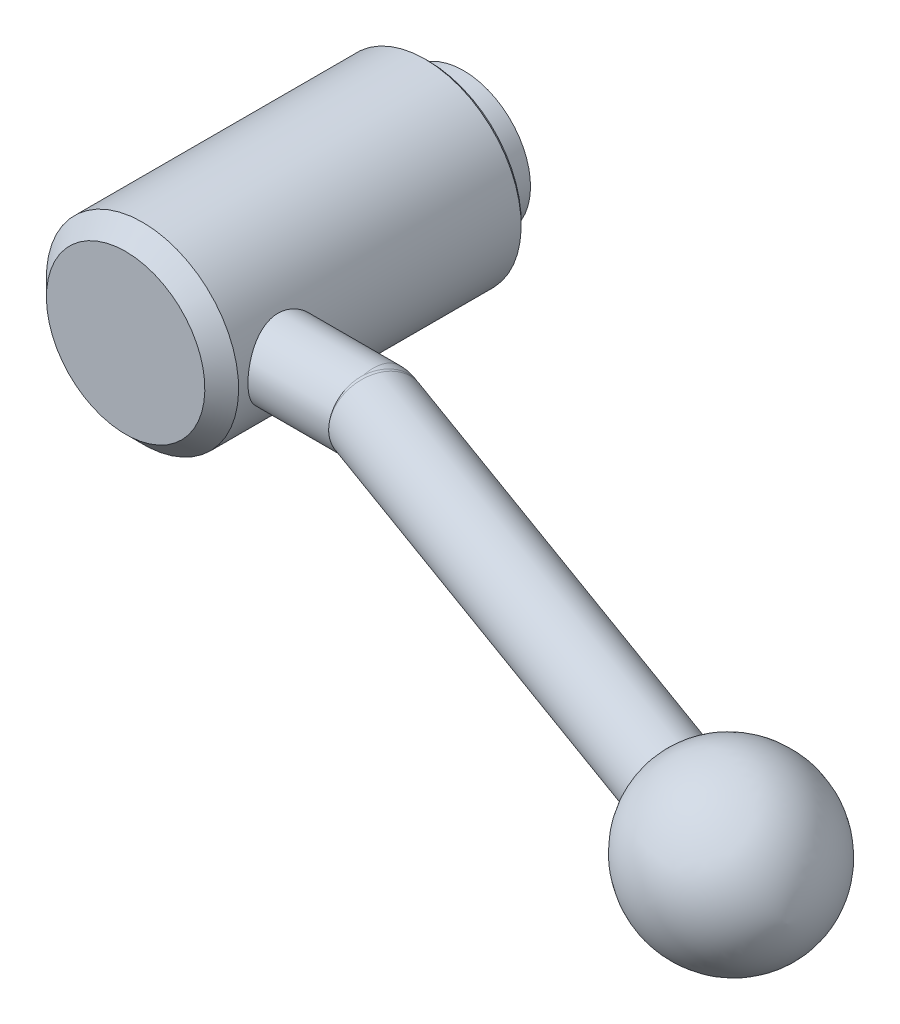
ISO-10303-21;
HEADER;
FILE_DESCRIPTION(('STEP AP214'),'2;1');
FILE_NAME('part.step','',(''),(''),'','','');
FILE_SCHEMA(('AUTOMOTIVE_DESIGN { 1 0 10303 214 1 1 1 1 }'));
ENDSEC;
DATA;
#1=APPLICATION_CONTEXT('core data for automotive mechanical design processes');
#2=APPLICATION_PROTOCOL_DEFINITION('international standard','automotive_design',2000,#1);
#3=PRODUCT_CONTEXT('',#1,'mechanical');
#4=PRODUCT('Part','Part','',(#3));
#5=PRODUCT_RELATED_PRODUCT_CATEGORY('part','',(#4));
#6=PRODUCT_DEFINITION_FORMATION('','',#4);
#7=PRODUCT_DEFINITION_CONTEXT('part definition',#1,'design');
#8=PRODUCT_DEFINITION('design','',#6,#7);
#9=PRODUCT_DEFINITION_SHAPE('','',#8);
#10=(LENGTH_UNIT() NAMED_UNIT(*) SI_UNIT(.MILLI.,.METRE.));
#11=(NAMED_UNIT(*) PLANE_ANGLE_UNIT() SI_UNIT($,.RADIAN.));
#12=(NAMED_UNIT(*) SI_UNIT($,.STERADIAN.) SOLID_ANGLE_UNIT());
#13=UNCERTAINTY_MEASURE_WITH_UNIT(LENGTH_MEASURE(1.E-05),#10,'distance_accuracy_value','');
#14=(GEOMETRIC_REPRESENTATION_CONTEXT(3) GLOBAL_UNCERTAINTY_ASSIGNED_CONTEXT((#13)) GLOBAL_UNIT_ASSIGNED_CONTEXT((#10,
#11,#12)) REPRESENTATION_CONTEXT('',''));
#15=CARTESIAN_POINT('',(0.,0.,0.));
#16=DIRECTION('',(0.,0.,1.));
#17=DIRECTION('',(1.,0.,0.));
#18=AXIS2_PLACEMENT_3D('',#15,#16,#17);
#19=CARTESIAN_POINT('',(0.,0.,0.));
#20=DIRECTION('',(0.,0.,-1.));
#21=DIRECTION('',(0.,1.,0.));
#22=AXIS2_PLACEMENT_3D('',#19,#20,#21);
#23=CYLINDRICAL_SURFACE('',#22,16.5);
#24=CARTESIAN_POINT('',(0.,0.,6.6));
#25=DIRECTION('',(0.,0.,-1.));
#26=DIRECTION('',(0.,1.,0.));
#27=AXIS2_PLACEMENT_3D('',#24,#25,#26);
#28=CIRCLE('',#27,16.5);
#29=CARTESIAN_POINT('',(0.,16.5,6.6));
#30=VERTEX_POINT('',#29);
#31=EDGE_CURVE('E145',#30,#30,#28,.T.);
#32=ORIENTED_EDGE('',*,*,#31,.F.);
#33=EDGE_LOOP('',(#32));
#34=FACE_BOUND('',#33,.T.);
#35=CARTESIAN_POINT('',(15.1657508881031,6.5,47.));
#36=CARTESIAN_POINT('',(15.1657521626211,6.49999870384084,47.1744094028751));
#37=CARTESIAN_POINT('',(15.1687696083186,6.49297069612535,47.3488754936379));
#38=CARTESIAN_POINT('',(15.180743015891,6.4649258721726,47.6965510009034));
#39=CARTESIAN_POINT('',(15.1897026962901,6.44390029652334,47.8697595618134));
#40=CARTESIAN_POINT('',(15.2132851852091,6.38802582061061,48.2139084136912));
#41=CARTESIAN_POINT('',(15.2279195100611,6.35314880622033,48.3848433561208));
#42=CARTESIAN_POINT('',(15.2623783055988,6.26991497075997,48.722930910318));
#43=CARTESIAN_POINT('',(15.2822049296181,6.22155255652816,48.890081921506));
#44=CARTESIAN_POINT('',(15.3263305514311,6.11204204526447,49.2187433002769));
#45=CARTESIAN_POINT('',(15.3506106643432,6.05094779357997,49.3802741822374));
#46=CARTESIAN_POINT('',(15.4029879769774,5.91634808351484,49.6975038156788));
#47=CARTESIAN_POINT('',(15.4310866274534,5.84283790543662,49.8532003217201));
#48=CARTESIAN_POINT('',(15.4902847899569,5.68403460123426,50.1577239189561));
#49=CARTESIAN_POINT('',(15.521382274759,5.59874941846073,50.3065555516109));
#50=CARTESIAN_POINT('',(15.5857773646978,5.41690395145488,50.5967321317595));
#51=CARTESIAN_POINT('',(15.6190757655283,5.32033957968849,50.7380743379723));
#52=CARTESIAN_POINT('',(15.6887204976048,5.11143504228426,51.0193834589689));
#53=CARTESIAN_POINT('',(15.7251359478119,4.99854682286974,51.1589265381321));
#54=CARTESIAN_POINT('',(15.7984684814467,4.76169722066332,51.4281356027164));
#55=CARTESIAN_POINT('',(15.8353855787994,4.6377355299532,51.5578013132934));
#56=CARTESIAN_POINT('',(15.9087724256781,4.37938333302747,51.8065762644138));
#57=CARTESIAN_POINT('',(15.9452419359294,4.24498750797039,51.9256800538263));
#58=CARTESIAN_POINT('',(16.0167582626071,3.96662276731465,52.1524872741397));
#59=CARTESIAN_POINT('',(16.0518055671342,3.82265718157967,52.2601946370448));
#60=CARTESIAN_POINT('',(16.1208941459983,3.52019152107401,52.467462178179));
#61=CARTESIAN_POINT('',(16.1548445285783,3.3613450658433,52.5665481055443));
#62=CARTESIAN_POINT('',(16.2192807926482,3.03521726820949,52.7508716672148));
#63=CARTESIAN_POINT('',(16.2497679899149,2.86793916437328,52.8361145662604));
#64=CARTESIAN_POINT('',(16.306415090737,2.52603369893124,52.9920322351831));
#65=CARTESIAN_POINT('',(16.3325754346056,2.35140708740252,53.062708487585));
#66=CARTESIAN_POINT('',(16.3798001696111,1.99606140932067,53.1888023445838));
#67=CARTESIAN_POINT('',(16.4008648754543,1.81534271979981,53.2442208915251));
#68=CARTESIAN_POINT('',(16.4364052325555,1.45784632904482,53.3369679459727));
#69=CARTESIAN_POINT('',(16.4511444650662,1.28128382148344,53.3750254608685));
#70=CARTESIAN_POINT('',(16.4750042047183,0.925236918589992,53.4363470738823));
#71=CARTESIAN_POINT('',(16.4841250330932,0.745752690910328,53.4596120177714));
#72=CARTESIAN_POINT('',(16.4964855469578,0.38532015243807,53.4910896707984));
#73=CARTESIAN_POINT('',(16.4997269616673,0.204372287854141,53.4993068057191));
#74=CARTESIAN_POINT('',(16.5002398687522,-0.157583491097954,53.500608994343));
#75=CARTESIAN_POINT('',(16.4975115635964,-0.33859140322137,53.4936945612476));
#76=CARTESIAN_POINT('',(16.4864766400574,-0.689328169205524,53.465606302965));
#77=CARTESIAN_POINT('',(16.4784837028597,-0.85913183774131,53.4452341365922));
#78=CARTESIAN_POINT('',(16.4574384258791,-1.19635679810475,53.3912360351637));
#79=CARTESIAN_POINT('',(16.444384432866,-1.36377729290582,53.3576057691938));
#80=CARTESIAN_POINT('',(16.4135516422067,-1.69498665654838,53.2774234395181));
#81=CARTESIAN_POINT('',(16.3957743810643,-1.85877668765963,53.2308755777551));
#82=CARTESIAN_POINT('',(16.3559249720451,-2.18179127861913,53.1252488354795));
#83=CARTESIAN_POINT('',(16.3338511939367,-2.34101407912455,53.0661651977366));
#84=CARTESIAN_POINT('',(16.2855961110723,-2.65615140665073,52.9350157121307));
#85=CARTESIAN_POINT('',(16.2593596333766,-2.81198390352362,52.8627732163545));
#86=CARTESIAN_POINT('',(16.2036445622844,-3.11704287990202,52.7064377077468));
#87=CARTESIAN_POINT('',(16.1741648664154,-3.26626708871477,52.6223406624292));
#88=CARTESIAN_POINT('',(16.1126670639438,-3.55725721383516,52.4428984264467));
#89=CARTESIAN_POINT('',(16.0806487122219,-3.69902240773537,52.3475521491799));
#90=CARTESIAN_POINT('',(16.0148235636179,-3.97435099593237,52.1462241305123));
#91=CARTESIAN_POINT('',(15.9810166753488,-4.10791397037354,52.0402418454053));
#92=CARTESIAN_POINT('',(15.9101988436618,-4.37444690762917,51.8111373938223));
#93=CARTESIAN_POINT('',(15.8731214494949,-4.50682971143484,51.687351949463));
#94=CARTESIAN_POINT('',(15.7988232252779,-4.76074389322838,51.4292307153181));
#95=CARTESIAN_POINT('',(15.7616024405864,-4.88227844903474,51.2948980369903));
#96=CARTESIAN_POINT('',(15.6879834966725,-5.11389804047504,51.0163266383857));
#97=CARTESIAN_POINT('',(15.6515859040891,-5.22397536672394,50.8720813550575));
#98=CARTESIAN_POINT('',(15.5806672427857,-5.43183822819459,50.5746385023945));
#99=CARTESIAN_POINT('',(15.5461454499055,-5.52962852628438,50.4214444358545));
#100=CARTESIAN_POINT('',(15.4790662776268,-5.71475871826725,50.1026478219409));
#101=CARTESIAN_POINT('',(15.4465879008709,-5.80174188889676,49.936821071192));
#102=CARTESIAN_POINT('',(15.3857195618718,-5.96128563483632,49.5977234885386));
#103=CARTESIAN_POINT('',(15.3573279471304,-6.03385204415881,49.4244557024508));
#104=CARTESIAN_POINT('',(15.3055990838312,-6.16388979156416,49.0716641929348));
#105=CARTESIAN_POINT('',(15.2822603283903,-6.22136563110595,48.8921423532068));
#106=CARTESIAN_POINT('',(15.2414756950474,-6.32062540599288,48.5281589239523));
#107=CARTESIAN_POINT('',(15.2240293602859,-6.36241055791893,48.3436977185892));
#108=CARTESIAN_POINT('',(15.1965377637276,-6.42778493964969,47.9824635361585));
#109=CARTESIAN_POINT('',(15.1861129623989,-6.45231123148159,47.8058886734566));
#110=CARTESIAN_POINT('',(15.1714222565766,-6.48677897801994,47.4510697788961));
#111=CARTESIAN_POINT('',(15.1671560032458,-6.4967212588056,47.2728258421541));
#112=CARTESIAN_POINT('',(15.1649343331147,-6.5019054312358,46.9161296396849));
#113=CARTESIAN_POINT('',(15.1669773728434,-6.49715091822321,46.7376774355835));
#114=CARTESIAN_POINT('',(15.1772980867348,-6.47300508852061,46.3819515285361));
#115=CARTESIAN_POINT('',(15.1855756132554,-6.45361411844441,46.2046777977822));
#116=CARTESIAN_POINT('',(15.2074545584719,-6.40187966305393,45.8623519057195));
#117=CARTESIAN_POINT('',(15.2207392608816,-6.37030447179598,45.6971624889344));
#118=CARTESIAN_POINT('',(15.2522135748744,-6.29457395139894,45.3701161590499));
#119=CARTESIAN_POINT('',(15.2704047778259,-6.25041454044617,45.2082603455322));
#120=CARTESIAN_POINT('',(15.3111508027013,-6.1499265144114,44.8889788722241));
#121=CARTESIAN_POINT('',(15.3337047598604,-6.09360031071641,44.7315523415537));
#122=CARTESIAN_POINT('',(15.3825547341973,-5.9692104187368,44.4219440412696));
#123=CARTESIAN_POINT('',(15.4088521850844,-5.90114223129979,44.2697643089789));
#124=CARTESIAN_POINT('',(15.4655807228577,-5.75087055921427,43.9656332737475));
#125=CARTESIAN_POINT('',(15.496133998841,-5.66821518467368,43.8139280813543));
#126=CARTESIAN_POINT('',(15.5596953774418,-5.4913305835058,43.5178983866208));
#127=CARTESIAN_POINT('',(15.5927043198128,-5.39709739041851,43.373576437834));
#128=CARTESIAN_POINT('',(15.6603145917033,-5.19765644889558,43.093084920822));
#129=CARTESIAN_POINT('',(15.6949161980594,-5.09244678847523,42.9569167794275));
#130=CARTESIAN_POINT('',(15.7648419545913,-4.87166967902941,42.6934495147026));
#131=CARTESIAN_POINT('',(15.8001661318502,-4.75610184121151,42.5661507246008));
#132=CARTESIAN_POINT('',(15.8732028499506,-4.50660710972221,42.3123157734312));
#133=CARTESIAN_POINT('',(15.910905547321,-4.37195833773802,42.1864851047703));
#134=CARTESIAN_POINT('',(15.985112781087,-4.09232041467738,41.9466012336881));
#135=CARTESIAN_POINT('',(16.0216176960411,-3.94733457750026,41.8325442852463));
#136=CARTESIAN_POINT('',(16.0924669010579,-3.64776716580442,41.6168903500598));
#137=CARTESIAN_POINT('',(16.1268102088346,-3.4931812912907,41.5152990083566));
#138=CARTESIAN_POINT('',(16.192362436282,-3.17548270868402,41.3254483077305));
#139=CARTESIAN_POINT('',(16.2235726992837,-3.01237370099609,41.2371832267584));
#140=CARTESIAN_POINT('',(16.2819868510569,-2.67872446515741,41.0747287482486));
#141=CARTESIAN_POINT('',(16.3091932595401,-2.50818899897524,41.0005304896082));
#142=CARTESIAN_POINT('',(16.3588360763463,-2.16084294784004,40.8668630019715));
#143=CARTESIAN_POINT('',(16.3812744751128,-1.98403501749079,40.8073876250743));
#144=CARTESIAN_POINT('',(16.4207336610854,-1.62543340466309,40.7037478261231));
#145=CARTESIAN_POINT('',(16.4377556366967,-1.44364082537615,40.6595800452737));
#146=CARTESIAN_POINT('',(16.4658759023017,-1.0764844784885,40.5870294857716));
#147=CARTESIAN_POINT('',(16.4769745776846,-0.89112094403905,40.5586456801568));
#148=CARTESIAN_POINT('',(16.4924035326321,-0.530232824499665,40.5192842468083));
#149=CARTESIAN_POINT('',(16.4971193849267,-0.354832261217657,40.5073144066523));
#150=CARTESIAN_POINT('',(16.5009342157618,-0.003578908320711,40.4976272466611));
#151=CARTESIAN_POINT('',(16.5000333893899,0.172273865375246,40.4999094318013));
#152=CARTESIAN_POINT('',(16.492639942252,0.523072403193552,40.5187002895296));
#153=CARTESIAN_POINT('',(16.4861480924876,0.698018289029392,40.5352070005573));
#154=CARTESIAN_POINT('',(16.4677497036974,1.04571908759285,40.5822707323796));
#155=CARTESIAN_POINT('',(16.4558431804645,1.21847400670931,40.6128277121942));
#156=CARTESIAN_POINT('',(16.427359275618,1.55551611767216,40.6865815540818));
#157=CARTESIAN_POINT('',(16.4109292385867,1.71990302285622,40.7293811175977));
#158=CARTESIAN_POINT('',(16.3736686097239,2.04442213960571,40.8275543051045));
#159=CARTESIAN_POINT('',(16.3528365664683,2.20455292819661,40.8829320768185));
#160=CARTESIAN_POINT('',(16.3072831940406,2.51948953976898,41.0057747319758));
#161=CARTESIAN_POINT('',(16.2825627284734,2.67429653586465,41.0732369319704));
#162=CARTESIAN_POINT('',(16.2298017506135,2.977796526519,41.2197632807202));
#163=CARTESIAN_POINT('',(16.201759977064,3.12648716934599,41.2988318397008));
#164=CARTESIAN_POINT('',(16.1417339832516,3.42320288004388,41.4716706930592));
#165=CARTESIAN_POINT('',(16.1096315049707,3.5709192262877,41.565929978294));
#166=CARTESIAN_POINT('',(16.0433028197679,3.85799821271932,41.7658374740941));
#167=CARTESIAN_POINT('',(16.0090758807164,3.99735794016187,41.8714896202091));
#168=CARTESIAN_POINT('',(15.9393375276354,4.266955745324,42.0935156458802));
#169=CARTESIAN_POINT('',(15.9038258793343,4.39719214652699,42.2098914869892));
#170=CARTESIAN_POINT('',(15.8323930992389,4.647828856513,42.4526787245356));
#171=CARTESIAN_POINT('',(15.796471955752,4.76822888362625,42.5790904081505));
#172=CARTESIAN_POINT('',(15.7229728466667,5.00544246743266,42.8491269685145));
#173=CARTESIAN_POINT('',(15.6854245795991,5.12160881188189,42.9933293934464));
#174=CARTESIAN_POINT('',(15.6119611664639,5.34135661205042,43.2913381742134));
#175=CARTESIAN_POINT('',(15.5760454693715,5.44494233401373,43.4451412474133));
#176=CARTESIAN_POINT('',(15.5068861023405,5.63889116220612,43.76158008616));
#177=CARTESIAN_POINT('',(15.4736440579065,5.72924625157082,43.9242211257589));
#178=CARTESIAN_POINT('',(15.4109193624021,5.89588782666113,44.2571658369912));
#179=CARTESIAN_POINT('',(15.3814348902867,5.9721811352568,44.427465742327));
#180=CARTESIAN_POINT('',(15.3295715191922,6.10399903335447,44.7594125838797));
#181=CARTESIAN_POINT('',(15.3067961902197,6.16075841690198,44.9205080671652));
#182=CARTESIAN_POINT('',(15.2658533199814,6.26152405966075,45.2471430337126));
#183=CARTESIAN_POINT('',(15.2476836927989,6.30553609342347,45.4126804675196));
#184=CARTESIAN_POINT('',(15.2165340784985,6.38033934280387,45.7467976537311));
#185=CARTESIAN_POINT('',(15.2035424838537,6.41116014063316,45.9153697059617));
#186=CARTESIAN_POINT('',(15.183110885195,6.45939917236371,46.2546841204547));
#187=CARTESIAN_POINT('',(15.1756675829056,6.4768253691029,46.4254251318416));
#188=CARTESIAN_POINT('',(15.1693292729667,6.49164558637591,46.6637445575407));
#189=CARTESIAN_POINT('',(15.1679883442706,6.49477751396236,46.7309454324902));
#190=CARTESIAN_POINT('',(15.1661988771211,6.49895503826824,46.8654280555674));
#191=CARTESIAN_POINT('',(15.1657503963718,6.50000050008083,46.9327098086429));
#192=CARTESIAN_POINT('',(15.1657508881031,6.5,47.));
#193=B_SPLINE_CURVE_WITH_KNOTS('',3,(#35,#36,#37,#38,#39,#40,#41,#42,#43,#44,#45,#46,#47,#48,
#49,#50,#51,#52,#53,#54,#55,#56,#57,#58,#59,#60,#61,#62,#63,#64,#65,#66,#67,#68,#69,#70,#71,#72,
#73,#74,#75,#76,#77,#78,#79,#80,#81,#82,#83,#84,#85,#86,#87,#88,#89,#90,#91,#92,#93,#94,#95,#96,
#97,#98,#99,#100,#101,#102,#103,#104,#105,#106,#107,#108,#109,#110,#111,#112,#113,#114,#115,
#116,#117,#118,#119,#120,#121,#122,#123,#124,#125,#126,#127,#128,#129,#130,#131,#132,#133,#134,
#135,#136,#137,#138,#139,#140,#141,#142,#143,#144,#145,#146,#147,#148,#149,#150,#151,#152,#153,
#154,#155,#156,#157,#158,#159,#160,#161,#162,#163,#164,#165,#166,#167,#168,#169,#170,#171,#172,
#173,#174,#175,#176,#177,#178,#179,#180,#181,#182,#183,#184,#185,#186,#187,#188,#189,#190,#191,
#192),.UNSPECIFIED.,.T.,.F.,(4,2,2,2,2,2,2,2,2,2,2,2,2,2,2,2,2,2,2,2,2,2,2,2,2,2,2,2,2,2,2,2,2,
2,2,2,2,2,2,2,2,2,2,2,2,2,2,2,2,2,2,2,2,2,2,2,2,2,2,2,2,2,2,2,2,2,2,2,2,2,2,2,2,2,2,2,2,2,4),
(0.,0.523159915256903,1.04664752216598,1.5712031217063,2.09597660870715,2.61857420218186,
3.14137090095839,3.66381663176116,4.18645228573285,4.73527747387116,5.28411792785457,
5.83324001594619,6.38217202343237,6.95226912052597,7.52214888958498,8.09197063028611,
8.66175716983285,9.20471085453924,9.74763349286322,10.2903964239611,10.8331409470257,
11.3461618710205,11.8593505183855,12.3723724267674,12.8855893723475,13.4062856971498,
13.9271595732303,14.4480838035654,14.9690346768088,15.5233891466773,16.0775806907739,
16.6321427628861,17.186489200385,17.755918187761,18.3251162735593,18.894144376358,
19.4631283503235,19.9981572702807,20.533155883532,21.0680236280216,21.6028787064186,
22.1084143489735,22.6141141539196,23.11971382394,23.6255076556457,24.1512658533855,
24.6772046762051,25.2032352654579,25.7292856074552,26.2929535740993,26.8564416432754,
27.4201839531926,27.9836835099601,28.5468269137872,29.1097347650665,29.6725190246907,
30.235266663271,30.7622239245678,31.2891628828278,31.8160291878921,32.3428939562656,
32.8542954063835,33.3658657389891,33.8773226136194,34.3889743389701,34.9228229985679,
35.4568566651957,35.990988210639,36.5251350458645,37.0912887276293,37.6572498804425,
38.2235525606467,38.7895797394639,39.3059532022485,39.8220923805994,40.3370679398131,
40.851737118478,41.0535682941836,41.2554125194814),.UNSPECIFIED.);
#194=CARTESIAN_POINT('',(15.1657508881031,6.5,47.));
#195=VERTEX_POINT('',#194);
#196=EDGE_CURVE('E22',#195,#195,#193,.T.);
#197=ORIENTED_EDGE('',*,*,#196,.F.);
#198=EDGE_LOOP('',(#197));
#199=FACE_BOUND('',#198,.T.);
#200=CARTESIAN_POINT('',(0.,0.,55.1));
#201=DIRECTION('',(0.,0.,-1.));
#202=DIRECTION('',(0.,1.,0.));
#203=AXIS2_PLACEMENT_3D('',#200,#201,#202);
#204=CIRCLE('',#203,16.5);
#205=CARTESIAN_POINT('',(0.,16.5,55.1));
#206=VERTEX_POINT('',#205);
#207=EDGE_CURVE('E147',#206,#206,#204,.T.);
#208=ORIENTED_EDGE('',*,*,#207,.T.);
#209=EDGE_LOOP('',(#208));
#210=FACE_BOUND('',#209,.T.);
#211=ADVANCED_FACE('F14',(#34,#199,#210),#23,.T.);
#212=CARTESIAN_POINT('',(0.,0.,58.));
#213=DIRECTION('',(0.,0.,-1.));
#214=DIRECTION('',(0.,1.,0.));
#215=AXIS2_PLACEMENT_3D('',#212,#213,#214);
#216=PLANE('',#215);
#217=CARTESIAN_POINT('',(0.,0.,58.));
#218=DIRECTION('',(0.,0.,-1.));
#219=DIRECTION('',(0.,1.,0.));
#220=AXIS2_PLACEMENT_3D('',#217,#218,#219);
#221=CIRCLE('',#220,13.6);
#222=CARTESIAN_POINT('',(0.,13.6,58.));
#223=VERTEX_POINT('',#222);
#224=EDGE_CURVE('E78',#223,#223,#221,.T.);
#225=ORIENTED_EDGE('',*,*,#224,.F.);
#226=EDGE_LOOP('',(#225));
#227=FACE_BOUND('',#226,.T.);
#228=ADVANCED_FACE('F16',(#227),#216,.F.);
#229=CARTESIAN_POINT('',(0.,0.,58.));
#230=DIRECTION('',(0.,0.,-1.));
#231=DIRECTION('',(0.,1.,0.));
#232=AXIS2_PLACEMENT_3D('',#229,#230,#231);
#233=CONICAL_SURFACE('',#232,13.6,0.785398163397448);
#234=ORIENTED_EDGE('',*,*,#207,.F.);
#235=EDGE_LOOP('',(#234));
#236=FACE_BOUND('',#235,.T.);
#237=ORIENTED_EDGE('',*,*,#224,.T.);
#238=EDGE_LOOP('',(#237));
#239=FACE_BOUND('',#238,.T.);
#240=ADVANCED_FACE('F64',(#236,#239),#233,.T.);
#241=CARTESIAN_POINT('',(0.,0.,6.6));
#242=DIRECTION('',(0.,0.,1.));
#243=DIRECTION('',(0.,-1.,0.));
#244=AXIS2_PLACEMENT_3D('',#241,#242,#243);
#245=CONICAL_SURFACE('',#244,16.5,0.785398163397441);
#246=CARTESIAN_POINT('',(0.,0.,6.));
#247=DIRECTION('',(0.,0.,-1.));
#248=DIRECTION('',(0.,1.,0.));
#249=AXIS2_PLACEMENT_3D('',#246,#247,#248);
#250=CIRCLE('',#249,15.9);
#251=CARTESIAN_POINT('',(0.,15.9,6.));
#252=VERTEX_POINT('',#251);
#253=EDGE_CURVE('E140',#252,#252,#250,.T.);
#254=ORIENTED_EDGE('',*,*,#253,.F.);
#255=EDGE_LOOP('',(#254));
#256=FACE_BOUND('',#255,.T.);
#257=ORIENTED_EDGE('',*,*,#31,.T.);
#258=EDGE_LOOP('',(#257));
#259=FACE_BOUND('',#258,.T.);
#260=ADVANCED_FACE('F70',(#256,#259),#245,.T.);
#261=CARTESIAN_POINT('',(15.9,0.,6.));
#262=DIRECTION('',(0.,0.,1.));
#263=DIRECTION('',(0.,-1.,0.));
#264=AXIS2_PLACEMENT_3D('',#261,#262,#263);
#265=PLANE('',#264);
#266=CARTESIAN_POINT('',(0.,0.,6.));
#267=DIRECTION('',(0.,0.,-1.));
#268=DIRECTION('',(0.,1.,0.));
#269=AXIS2_PLACEMENT_3D('',#266,#267,#268);
#270=CIRCLE('',#269,11.5);
#271=CARTESIAN_POINT('',(0.,11.5,6.));
#272=VERTEX_POINT('',#271);
#273=EDGE_CURVE('E138',#272,#272,#270,.T.);
#274=ORIENTED_EDGE('',*,*,#273,.F.);
#275=EDGE_LOOP('',(#274));
#276=FACE_BOUND('',#275,.T.);
#277=ORIENTED_EDGE('',*,*,#253,.T.);
#278=EDGE_LOOP('',(#277));
#279=FACE_BOUND('',#278,.T.);
#280=ADVANCED_FACE('F159',(#276,#279),#265,.F.);
#281=CARTESIAN_POINT('',(0.,0.,0.));
#282=DIRECTION('',(0.,0.,-1.));
#283=DIRECTION('',(0.,1.,0.));
#284=AXIS2_PLACEMENT_3D('',#281,#282,#283);
#285=CYLINDRICAL_SURFACE('',#284,11.5);
#286=CARTESIAN_POINT('',(0.,0.,0.));
#287=DIRECTION('',(0.,0.,-1.));
#288=DIRECTION('',(0.,1.,0.));
#289=AXIS2_PLACEMENT_3D('',#286,#287,#288);
#290=CIRCLE('',#289,11.5);
#291=CARTESIAN_POINT('',(0.,11.5,0.));
#292=VERTEX_POINT('',#291);
#293=EDGE_CURVE('E136',#292,#292,#290,.T.);
#294=ORIENTED_EDGE('',*,*,#293,.F.);
#295=EDGE_LOOP('',(#294));
#296=FACE_BOUND('',#295,.T.);
#297=ORIENTED_EDGE('',*,*,#273,.T.);
#298=EDGE_LOOP('',(#297));
#299=FACE_BOUND('',#298,.T.);
#300=ADVANCED_FACE('F133',(#296,#299),#285,.T.);
#301=CARTESIAN_POINT('',(11.5,0.,0.));
#302=DIRECTION('',(0.,0.,1.));
#303=DIRECTION('',(0.,-1.,0.));
#304=AXIS2_PLACEMENT_3D('',#301,#302,#303);
#305=PLANE('',#304);
#306=CARTESIAN_POINT('',(0.,0.,0.));
#307=DIRECTION('',(0.,0.,-1.));
#308=DIRECTION('',(0.,1.,0.));
#309=AXIS2_PLACEMENT_3D('',#306,#307,#308);
#310=CIRCLE('',#309,8.);
#311=CARTESIAN_POINT('',(0.,8.,0.));
#312=VERTEX_POINT('',#311);
#313=EDGE_CURVE('E122',#312,#312,#310,.T.);
#314=ORIENTED_EDGE('',*,*,#313,.F.);
#315=EDGE_LOOP('',(#314));
#316=FACE_BOUND('',#315,.T.);
#317=ORIENTED_EDGE('',*,*,#293,.T.);
#318=EDGE_LOOP('',(#317));
#319=FACE_BOUND('',#318,.T.);
#320=ADVANCED_FACE('F86',(#316,#319),#305,.F.);
#321=CARTESIAN_POINT('',(38.,0.,47.));
#322=DIRECTION('',(1.,0.,0.));
#323=DIRECTION('',(0.,1.,0.));
#324=AXIS2_PLACEMENT_3D('',#321,#322,#323);
#325=CYLINDRICAL_SURFACE('',#324,6.5);
#326=CARTESIAN_POINT('',(31.5002,-6.28048269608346,48.6749737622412));
#327=CARTESIAN_POINT('',(31.4701911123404,-6.25848550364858,48.7574684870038));
#328=CARTESIAN_POINT('',(31.4414052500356,-6.2347500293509,48.8399237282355));
#329=CARTESIAN_POINT('',(31.3859523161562,-6.18381246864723,49.0044625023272));
#330=CARTESIAN_POINT('',(31.3592849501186,-6.15661086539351,49.0865460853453));
#331=CARTESIAN_POINT('',(31.2819864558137,-6.06984393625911,49.3317442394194));
#332=CARTESIAN_POINT('',(31.234026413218,-6.00509209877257,49.4938982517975));
#333=CARTESIAN_POINT('',(31.1437652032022,-5.86212891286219,49.8135555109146));
#334=CARTESIAN_POINT('',(31.1014588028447,-5.78393016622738,49.971062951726));
#335=CARTESIAN_POINT('',(31.0215196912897,-5.61443273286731,50.2801227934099));
#336=CARTESIAN_POINT('',(30.9838873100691,-5.52313312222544,50.4316747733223));
#337=CARTESIAN_POINT('',(30.9127228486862,-5.32805112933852,50.7273614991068));
#338=CARTESIAN_POINT('',(30.8791877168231,-5.22427815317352,50.871501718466));
#339=CARTESIAN_POINT('',(30.815774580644,-5.00483968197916,51.1512875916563));
#340=CARTESIAN_POINT('',(30.7858966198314,-4.88917404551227,51.2869331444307));
#341=CARTESIAN_POINT('',(30.7295154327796,-4.64671898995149,51.548605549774));
#342=CARTESIAN_POINT('',(30.7030116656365,-4.51993135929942,51.6746339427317));
#343=CARTESIAN_POINT('',(30.6531671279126,-4.25605741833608,51.9160918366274));
#344=CARTESIAN_POINT('',(30.6298263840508,-4.1189710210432,52.0315212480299));
#345=CARTESIAN_POINT('',(30.5859306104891,-3.83395076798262,52.2520111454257));
#346=CARTESIAN_POINT('',(30.5654071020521,-3.68591886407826,52.3569512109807));
#347=CARTESIAN_POINT('',(30.527316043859,-3.38127311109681,52.5542722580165));
#348=CARTESIAN_POINT('',(30.5097495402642,-3.22465625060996,52.6466487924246));
#349=CARTESIAN_POINT('',(30.4775004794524,-2.90402878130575,52.8180456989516));
#350=CARTESIAN_POINT('',(30.4628174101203,-2.74001949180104,52.8970684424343));
#351=CARTESIAN_POINT('',(30.4362651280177,-2.40569424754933,53.0411738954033));
#352=CARTESIAN_POINT('',(30.424396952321,-2.23537599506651,53.1062514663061));
#353=CARTESIAN_POINT('',(30.4035252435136,-1.89117431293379,53.2214241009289));
#354=CARTESIAN_POINT('',(30.3944984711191,-1.71733288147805,53.2716404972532));
#355=CARTESIAN_POINT('',(30.3791416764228,-1.3658896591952,53.3574425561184));
#356=CARTESIAN_POINT('',(30.3728126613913,-1.18828648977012,53.3930227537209));
#357=CARTESIAN_POINT('',(30.3628391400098,-0.830755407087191,53.4492305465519));
#358=CARTESIAN_POINT('',(30.3591931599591,-0.650828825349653,53.4698663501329));
#359=CARTESIAN_POINT('',(30.3545680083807,-0.289765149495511,53.496061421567));
#360=CARTESIAN_POINT('',(30.3535900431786,-0.108627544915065,53.5016138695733));
#361=CARTESIAN_POINT('',(30.3542996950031,0.252555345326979,53.4975893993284));
#362=CARTESIAN_POINT('',(30.355973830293,0.432601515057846,53.4880890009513));
#363=CARTESIAN_POINT('',(30.3619660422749,0.79115770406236,53.4541833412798));
#364=CARTESIAN_POINT('',(30.3662829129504,0.969668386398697,53.429784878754));
#365=CARTESIAN_POINT('',(30.3775753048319,1.32405576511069,53.3662625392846));
#366=CARTESIAN_POINT('',(30.384552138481,1.49993111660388,53.3271313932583));
#367=CARTESIAN_POINT('',(30.4011832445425,1.84764570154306,53.2344660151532));
#368=CARTESIAN_POINT('',(30.4108365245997,2.01948640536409,53.1809371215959));
#369=CARTESIAN_POINT('',(30.4328583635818,2.35804742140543,53.0598634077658));
#370=CARTESIAN_POINT('',(30.4452278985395,2.52476586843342,52.9923135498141));
#371=CARTESIAN_POINT('',(30.4727213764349,2.85178734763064,52.843761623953));
#372=CARTESIAN_POINT('',(30.4878443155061,3.01209269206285,52.7627644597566));
#373=CARTESIAN_POINT('',(30.5209144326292,3.32526997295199,52.5879110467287));
#374=CARTESIAN_POINT('',(30.5388622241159,3.47814028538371,52.4940520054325));
#375=CARTESIAN_POINT('',(30.5776589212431,3.77530504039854,52.2942532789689));
#376=CARTESIAN_POINT('',(30.5985068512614,3.91960234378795,52.1883176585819));
#377=CARTESIAN_POINT('',(30.6433408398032,4.19941993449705,51.9645872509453));
#378=CARTESIAN_POINT('',(30.6673426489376,4.33489069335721,51.8467336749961));
#379=CARTESIAN_POINT('',(30.7185603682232,4.59531298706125,51.6005655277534));
#380=CARTESIAN_POINT('',(30.7457763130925,4.72026440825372,51.4722508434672));
#381=CARTESIAN_POINT('',(30.8036465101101,4.95882988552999,51.20617837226));
#382=CARTESIAN_POINT('',(30.8343011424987,5.07244268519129,51.0684195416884));
#383=CARTESIAN_POINT('',(30.8993555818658,5.28757920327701,50.7846019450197));
#384=CARTESIAN_POINT('',(30.9337552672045,5.38910331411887,50.6385434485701));
#385=CARTESIAN_POINT('',(31.0048466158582,5.5744837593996,50.3471450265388));
#386=CARTESIAN_POINT('',(31.0413260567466,5.65898432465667,50.2021627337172));
#387=CARTESIAN_POINT('',(31.1186048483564,5.81610839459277,49.9070309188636));
#388=CARTESIAN_POINT('',(31.1594036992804,5.88873327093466,49.7568819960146));
#389=CARTESIAN_POINT('',(31.2461889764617,6.0218129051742,49.4526179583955));
#390=CARTESIAN_POINT('',(31.2921778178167,6.08226196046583,49.2985010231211));
#391=CARTESIAN_POINT('',(31.366062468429,6.16360062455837,49.0656236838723));
#392=CARTESIAN_POINT('',(31.3915152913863,6.18916346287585,48.9876924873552));
#393=CARTESIAN_POINT('',(31.4443438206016,6.23716716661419,48.8315099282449));
#394=CARTESIAN_POINT('',(31.4717197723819,6.25960763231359,48.753258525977));
#395=CARTESIAN_POINT('',(31.5001999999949,6.28048269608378,48.6749737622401));
#396=B_SPLINE_CURVE_WITH_KNOTS('',3,(#326,#327,#328,#329,#330,#331,#332,#333,#334,#335,#336,
#337,#338,#339,#340,#341,#342,#343,#344,#345,#346,#347,#348,#349,#350,#351,#352,#353,#354,#355,
#356,#357,#358,#359,#360,#361,#362,#363,#364,#365,#366,#367,#368,#369,#370,#371,#372,#373,#374,
#375,#376,#377,#378,#379,#380,#381,#382,#383,#384,#385,#386,#387,#388,#389,#390,#391,#392,#393,
#394,#395),.UNSPECIFIED.,.F.,.F.,(4,2,2,2,2,2,2,2,2,2,2,2,2,2,2,2,2,2,2,2,2,2,2,2,2,2,2,2,2,2,2,
2,2,2,4),(0.,0.27143395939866,0.542830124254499,1.08532167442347,1.62730757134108,
2.16933170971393,2.71094964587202,3.25257402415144,3.79411146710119,4.3356534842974,
4.88283172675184,5.43020315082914,5.97747727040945,6.52495270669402,7.06782653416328,
7.61090287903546,8.15368070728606,8.69670390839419,9.23697554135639,9.77700080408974,
10.3172928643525,10.8573848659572,11.3976712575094,11.9377610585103,12.4779683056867,
13.0179942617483,13.5608276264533,14.1036668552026,14.6465661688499,15.1894478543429,
15.7040975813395,16.2186878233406,16.733518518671,16.9910761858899,17.2486667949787),.UNSPECIFIED.);
#397=CARTESIAN_POINT('',(31.5,-6.28033613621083,48.6755232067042));
#398=VERTEX_POINT('',#397);
#399=CARTESIAN_POINT('',(30.3538746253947,0.,53.5));
#400=VERTEX_POINT('',#399);
#401=EDGE_CURVE('E29',#398,#400,#396,.T.);
#402=ORIENTED_EDGE('',*,*,#401,.T.);
#403=CARTESIAN_POINT('',(31.5,6.28033613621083,48.6755232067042));
#404=VERTEX_POINT('',#403);
#405=EDGE_CURVE('E91',#400,#404,#396,.T.);
#406=ORIENTED_EDGE('',*,*,#405,.T.);
#407=CARTESIAN_POINT('',(31.5,0.,47.));
#408=DIRECTION('',(1.,0.,0.));
#409=DIRECTION('',(0.,1.,0.));
#410=AXIS2_PLACEMENT_3D('',#407,#408,#409);
#411=CIRCLE('',#410,6.5);
#412=EDGE_CURVE('E100',#398,#404,#411,.T.);
#413=ORIENTED_EDGE('',*,*,#412,.F.);
#414=EDGE_LOOP('',(#402,#406,#413));
#415=FACE_BOUND('',#414,.T.);
#416=ORIENTED_EDGE('',*,*,#196,.T.);
#417=EDGE_LOOP('',(#416));
#418=FACE_BOUND('',#417,.T.);
#419=ADVANCED_FACE('F80',(#415,#418),#325,.T.);
#420=CARTESIAN_POINT('',(31.5,0.,47.));
#421=DIRECTION('',(1.,0.,0.));
#422=DIRECTION('',(0.,0.,-1.));
#423=AXIS2_PLACEMENT_3D('',#420,#421,#422);
#424=SPHERICAL_SURFACE('',#423,6.5);
#425=CARTESIAN_POINT('',(32.0385027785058,0.,47.1959989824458));
#426=DIRECTION('',(0.939692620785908,0.,0.342020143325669));
#427=DIRECTION('',(-0.342020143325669,0.,0.939692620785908));
#428=AXIS2_PLACEMENT_3D('',#425,#426,#427);
#429=CIRCLE('',#428,6.47468911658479);
#430=EDGE_CURVE('E9',#398,#404,#429,.T.);
#431=ORIENTED_EDGE('',*,*,#430,.F.);
#432=ORIENTED_EDGE('',*,*,#412,.T.);
#433=EDGE_LOOP('',(#431,#432));
#434=FACE_BOUND('',#433,.T.);
#435=ADVANCED_FACE('F85',(#434),#424,.T.);
#436=CARTESIAN_POINT('',(32.5770055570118,0.,47.3919979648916));
#437=DIRECTION('',(0.939692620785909,0.,0.342020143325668));
#438=DIRECTION('',(-0.342020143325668,0.,0.939692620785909));
#439=AXIS2_PLACEMENT_3D('',#436,#437,#438);
#440=SPHERICAL_SURFACE('',#439,6.5);
#441=ORIENTED_EDGE('',*,*,#401,.F.);
#442=ORIENTED_EDGE('',*,*,#430,.T.);
#443=ORIENTED_EDGE('',*,*,#405,.F.);
#444=CARTESIAN_POINT('',(32.5770055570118,0.,47.3919979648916));
#445=DIRECTION('',(0.939692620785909,0.,0.342020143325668));
#446=DIRECTION('',(-0.342020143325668,0.,0.939692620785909));
#447=AXIS2_PLACEMENT_3D('',#444,#445,#446);
#448=CIRCLE('',#447,6.5);
#449=EDGE_CURVE('E98',#400,#400,#448,.T.);
#450=ORIENTED_EDGE('',*,*,#449,.F.);
#451=EDGE_LOOP('',(#441,#442,#443,#450));
#452=FACE_BOUND('',#451,.T.);
#453=ADVANCED_FACE('F102',(#452),#440,.T.);
#454=CARTESIAN_POINT('',(143.071394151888,0.,87.6086664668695));
#455=DIRECTION('',(0.939692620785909,0.,0.342020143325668));
#456=DIRECTION('',(-0.342020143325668,0.,0.939692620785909));
#457=AXIS2_PLACEMENT_3D('',#454,#455,#456);
#458=CYLINDRICAL_SURFACE('',#457,6.5);
#459=CARTESIAN_POINT('',(116.052479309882,0.,77.774585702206));
#460=DIRECTION('',(0.939692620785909,0.,0.342020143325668));
#461=DIRECTION('',(-0.342020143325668,0.,0.939692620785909));
#462=AXIS2_PLACEMENT_3D('',#459,#460,#461);
#463=CIRCLE('',#462,6.5);
#464=CARTESIAN_POINT('',(113.829348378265,0.,83.8825877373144));
#465=VERTEX_POINT('',#464);
#466=EDGE_CURVE('E114',#465,#465,#463,.T.);
#467=ORIENTED_EDGE('',*,*,#466,.F.);
#468=EDGE_LOOP('',(#467));
#469=FACE_BOUND('',#468,.T.);
#470=ORIENTED_EDGE('',*,*,#449,.T.);
#471=EDGE_LOOP('',(#470));
#472=FACE_BOUND('',#471,.T.);
#473=ADVANCED_FACE('F54',(#469,#472),#458,.T.);
#474=CARTESIAN_POINT('',(113.829348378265,0.,83.8825877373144));
#475=DIRECTION('',(0.939692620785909,0.,0.342020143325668));
#476=DIRECTION('',(-0.342020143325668,0.,0.939692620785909));
#477=AXIS2_PLACEMENT_3D('',#474,#475,#476);
#478=PLANE('',#477);
#479=CARTESIAN_POINT('',(116.052479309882,0.,77.774585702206));
#480=DIRECTION('',(0.939692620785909,0.,0.342020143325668));
#481=DIRECTION('',(-0.342020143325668,0.,0.939692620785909));
#482=AXIS2_PLACEMENT_3D('',#479,#480,#481);
#483=CIRCLE('',#482,8.37359520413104);
#484=CARTESIAN_POINT('',(113.188541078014,0.,85.6431913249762));
#485=VERTEX_POINT('',#484);
#486=EDGE_CURVE('E117',#485,#485,#483,.T.);
#487=ORIENTED_EDGE('',*,*,#486,.F.);
#488=EDGE_LOOP('',(#487));
#489=FACE_BOUND('',#488,.T.);
#490=ORIENTED_EDGE('',*,*,#466,.T.);
#491=EDGE_LOOP('',(#490));
#492=FACE_BOUND('',#491,.T.);
#493=ADVANCED_FACE('F43',(#489,#492),#478,.F.);
#494=CARTESIAN_POINT('',(128.5,0.,81.));
#495=DIRECTION('',(0.,1.,0.));
#496=DIRECTION('',(-0.342020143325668,0.,0.939692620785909));
#497=AXIS2_PLACEMENT_3D('',#494,#495,#496);
#498=CIRCLE('',#497,16.);
#499=TRIMMED_CURVE('',#498,(PARAMETER_VALUE(-1.49407077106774)),
(PARAMETER_VALUE(1.49407077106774)),.T.,.PARAMETER.);
#500=CARTESIAN_POINT('',(128.080544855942,0.,82.1524435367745));
#501=DIRECTION('',(0.939692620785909,0.,0.342020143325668));
#502=AXIS1_PLACEMENT('',#500,#501);
#503=SURFACE_OF_REVOLUTION('',#499,#502);
#504=ORIENTED_EDGE('',*,*,#486,.T.);
#505=EDGE_LOOP('',(#504));
#506=FACE_BOUND('',#505,.T.);
#507=CARTESIAN_POINT('',(143.071394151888,0.,87.6086664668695));
#508=VERTEX_POINT('',#507);
#509=VERTEX_LOOP('',#508);
#510=FACE_BOUND('',#509,.T.);
#511=ADVANCED_FACE('F40',(#506,#510),#503,.T.);
#512=CARTESIAN_POINT('',(0.,0.,23.));
#513=DIRECTION('',(0.,0.,-1.));
#514=DIRECTION('',(0.,1.,0.));
#515=AXIS2_PLACEMENT_3D('',#512,#513,#514);
#516=CYLINDRICAL_SURFACE('',#515,8.);
#517=CARTESIAN_POINT('',(0.,0.,23.));
#518=DIRECTION('',(0.,0.,-1.));
#519=DIRECTION('',(0.,1.,0.));
#520=AXIS2_PLACEMENT_3D('',#517,#518,#519);
#521=CIRCLE('',#520,8.);
#522=CARTESIAN_POINT('',(0.,8.,23.));
#523=VERTEX_POINT('',#522);
#524=EDGE_CURVE('E119',#523,#523,#521,.T.);
#525=ORIENTED_EDGE('',*,*,#524,.F.);
#526=EDGE_LOOP('',(#525));
#527=FACE_BOUND('',#526,.T.);
#528=ORIENTED_EDGE('',*,*,#313,.T.);
#529=EDGE_LOOP('',(#528));
#530=FACE_BOUND('',#529,.T.);
#531=ADVANCED_FACE('F42',(#527,#530),#516,.F.);
#532=CARTESIAN_POINT('',(0.,0.,23.));
#533=DIRECTION('',(0.,0.,-1.));
#534=DIRECTION('',(0.,1.,0.));
#535=AXIS2_PLACEMENT_3D('',#532,#533,#534);
#536=PLANE('',#535);
#537=ORIENTED_EDGE('',*,*,#524,.T.);
#538=EDGE_LOOP('',(#537));
#539=FACE_BOUND('',#538,.T.);
#540=ADVANCED_FACE('F51',(#539),#536,.T.);
#541=CLOSED_SHELL('',(#211,#228,#240,#260,#280,#300,#320,#419,#435,#453,#473,#493,#511,#531,#540));
#542=MANIFOLD_SOLID_BREP('B1',#541);
#543=ADVANCED_BREP_SHAPE_REPRESENTATION('',(#18,#542),#14);
#544=SHAPE_DEFINITION_REPRESENTATION(#9,#543);
ENDSEC;
END-ISO-10303-21;
